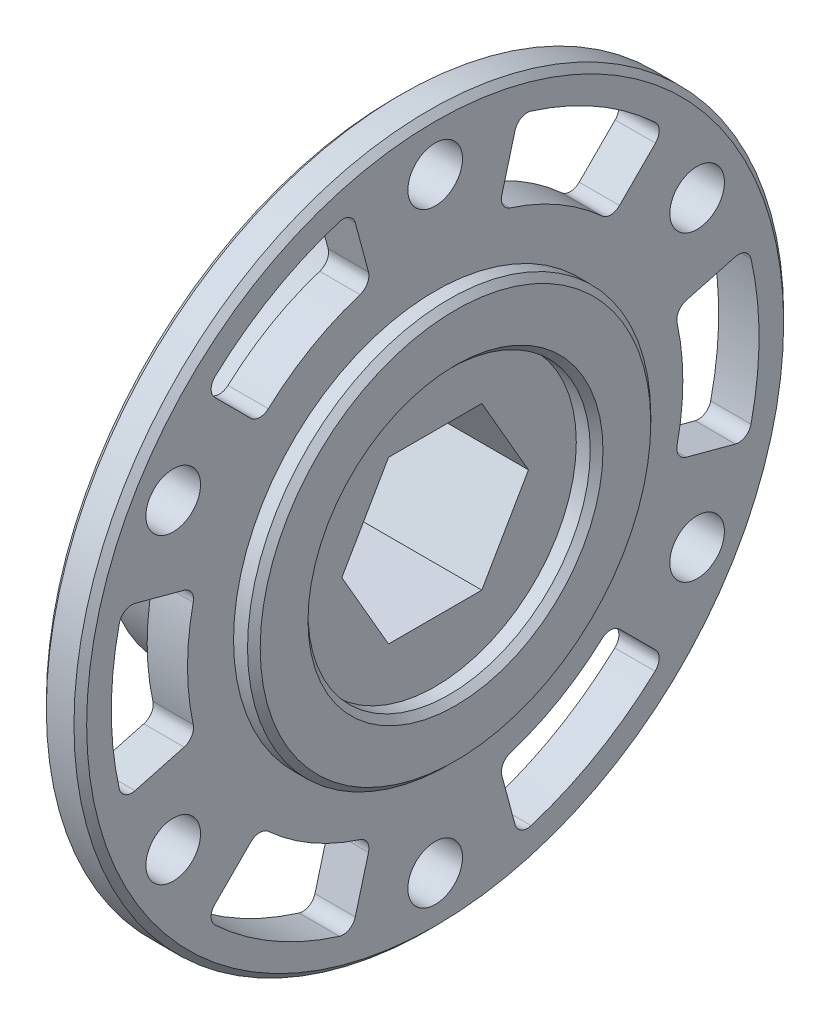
from build123d import *

# Parameters (mm, degrees)
SKETCH1_W                      = 3.175
SKETCH1_H                      = 27.94
SKETCH2_R                      = 15.875
BOSS_EXTRUDE1_DEPTH            = 1.6002
SKETCH3_R                      = 14.295
BOSS_EXTRUDE2_DEPTH            = 9.525
CUT_EXTRUDE1_DEPTH             = 43.021219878
CUT_EXTRUDE2_DEPTH             = 42.503941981
CUT_EXTRUDE3_DEPTH             = 42.503941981
CUT_EXTRUDE4_DEPTH             = 42.503941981
CUT_EXTRUDE5_DEPTH             = 42.503941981
CUT_EXTRUDE6_DEPTH             = 42.503941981
CUT_EXTRUDE7_DEPTH             = 41.644960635
SKETCH11_W                     = 1.6002
SKETCH11_H                     = 11.1125
F_4_3_4_3_DIAMETER_HOLE1_D     = 4.3
F_4_3_4_3_DIAMETER_HOLE1_DEPTH = 4.7752
CHAMFER1_SIZE                  = 0.5
CHAMFER2_SIZE                  = 1
FILLET1_R                      = 1


with BuildPart() as part:
    # Sketch1 → Revolve1 (revolve)
    with BuildSketch(Plane(origin=(0, 0, 0), x_dir=(-1, 0, 0), z_dir=(0, 0, -1)), mode=Mode.PRIVATE) as revolve1_sk:
        with Locations((-11.1125, 13.97)):
            Rectangle(SKETCH1_W, SKETCH1_H)
    revolve(revolve1_sk.sketch.rotate(Axis((12.7, 0, 0), (-1, 0, 0)), 270), axis=Axis((12.7, 0, 0), (-1, 0, 0)))

    # Sketch2 → Boss-Extrude1 (add)
    with BuildSketch(Plane(origin=(12.7, 0, 0), x_dir=(0, 0, -1), z_dir=(1, 0, 0))):
        with Locations(Location((0, 0, 0), (0, 0, 180))):
            Circle(SKETCH2_R)
    extrude(amount=BOSS_EXTRUDE1_DEPTH)

    # Sketch3 → Boss-Extrude2 (add)
    with BuildSketch(Plane.ZY.offset(-9.525)):
        with Locations(Location((0, 0, 0), (0, 0, 180))):
            Circle(SKETCH3_R)
    extrude(amount=BOSS_EXTRUDE2_DEPTH)

    # Sketch4 → Cut-Extrude1 (cut, through all)
    with BuildSketch(Plane.ZY):
        Polygon((3.673506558, 6.3627), (-3.673506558, 6.3627), (-7.347013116, 0), (-3.673506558, -6.3627), (3.673506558, -6.3627), (7.347013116, 0), align=None)
    extrude(amount=-CUT_EXTRUDE1_DEPTH, mode=Mode.SUBTRACT)

    # Sketch5 → Cut-Extrude2 (cut, through all)
    with BuildSketch(Plane(origin=(12.7, 0, 0), x_dir=(0, 0, -1), z_dir=(1, 0, 0))):
        with BuildLine():
            Line((-24.618120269, -6.648169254), (-18.822550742, -5.09525108))
            ThreePointArc((-18.822550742, -5.09525108), (-19.5, 0), (-18.822550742, 5.09525108))
            Line((-18.822550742, 5.09525108), (-24.618120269, 6.648169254))
            ThreePointArc((-24.618120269, 6.648169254), (-25.5, 0), (-24.618120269, -6.648169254))
        make_face()
    extrude(amount=-CUT_EXTRUDE2_DEPTH, mode=Mode.SUBTRACT)

    # Sketch6 → Cut-Extrude3 (cut, through all)
    with BuildSketch(Plane(origin=(12.7, 0, 0), x_dir=(0, 0, -1), z_dir=(1, 0, 0))):
        with BuildLine():
            Line((-18.066543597, 17.995832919), (-13.823892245, 13.753181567))
            ThreePointArc((-13.823892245, 13.753181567), (-9.75, 16.887495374), (-4.998658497, 18.848432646))
            Line((-4.998658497, 18.848432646), (-6.551576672, 24.644002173))
            ThreePointArc((-6.551576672, 24.644002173), (-12.75, 22.083647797), (-18.066543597, 17.995832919))
        make_face()
    extrude(amount=-CUT_EXTRUDE3_DEPTH, mode=Mode.SUBTRACT)

    # Sketch7 → Cut-Extrude4 (cut, through all)
    with BuildSketch(Plane(origin=(12.7, 0, 0), x_dir=(0, 0, -1), z_dir=(1, 0, 0))):
        with BuildLine():
            Line((6.551576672, 24.644002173), (4.998658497, 18.848432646))
            ThreePointArc((4.998658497, 18.848432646), (9.75, 16.887495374), (13.823892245, 13.753181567))
            Line((13.823892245, 13.753181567), (18.066543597, 17.995832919))
            ThreePointArc((18.066543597, 17.995832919), (12.75, 22.083647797), (6.551576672, 24.644002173))
        make_face()
    extrude(amount=-CUT_EXTRUDE4_DEPTH, mode=Mode.SUBTRACT)

    # Sketch8 → Cut-Extrude5 (cut, through all)
    with BuildSketch(Plane(origin=(12.7, 0, 0), x_dir=(0, 0, -1), z_dir=(1, 0, 0))):
        with BuildLine():
            Line((24.618120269, 6.648169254), (18.822550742, 5.09525108))
            ThreePointArc((18.822550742, 5.09525108), (19.5, 0), (18.822550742, -5.09525108))
            Line((18.822550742, -5.09525108), (24.618120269, -6.648169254))
            ThreePointArc((24.618120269, -6.648169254), (25.5, 0), (24.618120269, 6.648169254))
        make_face()
    extrude(amount=-CUT_EXTRUDE5_DEPTH, mode=Mode.SUBTRACT)

    # Sketch9 → Cut-Extrude6 (cut, through all)
    with BuildSketch(Plane(origin=(12.7, 0, 0), x_dir=(0, 0, -1), z_dir=(1, 0, 0))):
        with BuildLine():
            Line((18.066543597, -17.995832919), (13.823892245, -13.753181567))
            ThreePointArc((13.823892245, -13.753181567), (9.75, -16.887495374), (4.998658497, -18.848432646))
            Line((4.998658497, -18.848432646), (6.551576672, -24.644002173))
            ThreePointArc((6.551576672, -24.644002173), (12.75, -22.083647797), (18.066543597, -17.995832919))
        make_face()
    extrude(amount=-CUT_EXTRUDE6_DEPTH, mode=Mode.SUBTRACT)

    # Sketch10 → Cut-Extrude7 (cut, through all)
    with BuildSketch(Plane.ZY.offset(-9.525)):
        with BuildLine():
            Line((18.066543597, -17.995832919), (13.823892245, -13.753181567))
            ThreePointArc((13.823892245, -13.753181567), (9.75, -16.887495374), (4.998658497, -18.848432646))
            Line((4.998658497, -18.848432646), (6.551576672, -24.644002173))
            ThreePointArc((6.551576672, -24.644002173), (12.75, -22.083647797), (18.066543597, -17.995832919))
        make_face()
    extrude(amount=-CUT_EXTRUDE7_DEPTH, mode=Mode.SUBTRACT)

    # Sketch11 → Cut-Revolve1 (revolve, cut)
    with BuildSketch(Plane(origin=(0, 0, 0), x_dir=(1, 0, 0), z_dir=(0, 1, 0))):
        with Locations((13.5001, 5.55625)):
            Rectangle(SKETCH11_W, SKETCH11_H)
    revolve(axis=Axis((12.7, 0, 0), (1, 0, 0)), mode=Mode.SUBTRACT)

    # 4.3 _4.3_ Diameter Hole1
    with Locations(Plane.ZY.offset(-9.525)):
        with Locations((-20.624394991, -11.9075), (-20.624394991, 11.9075), (0, 23.815), (20.624394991, 11.9075), (20.624394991, -11.9075), (0, -23.815)):
            Hole(F_4_3_4_3_DIAMETER_HOLE1_D / 2, depth=F_4_3_4_3_DIAMETER_HOLE1_DEPTH)

    # Chamfer1
    chamfer1_edges = [part.edges().sort_by_distance(p)[0] for p in [
        (14.3002, 0, 11.1125),
        (9.525, 0, -27.94),
        (12.7, 0, -27.94),
        (14.3002, 0, -15.875),
    ]]
    chamfer(chamfer1_edges, length=CHAMFER1_SIZE)

    # Chamfer2
    chamfer2_edges = [part.edges().sort_by_distance(p)[0] for p in [
        (0, 0, 14.295),
    ]]
    chamfer(chamfer2_edges, length=CHAMFER2_SIZE)

    # Fillet1
    fillet1_edges = [part.edges().sort_by_distance(p)[0] for p in [
        (11.1125, 6.648169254, -24.618120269),
        (11.1125, -6.648169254, -24.618120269),
        (11.1125, -5.09525108, -18.822550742),
        (11.1125, 5.09525108, -18.822550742),
        (11.1125, -17.995832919, -18.066543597),
        (11.1125, -24.644002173, -6.551576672),
        (11.1125, -18.848432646, -4.998658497),
        (11.1125, -13.753181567, -13.823892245),
        (9.525, 0, 14.295),
        (11.1125, -17.995832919, 18.066543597),
        (11.1125, -24.644002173, 6.551576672),
        (11.1125, -18.848432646, 4.998658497),
        (11.1125, -13.753181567, 13.823892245),
        (11.1125, -6.648169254, 24.618120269),
        (11.1125, 6.648169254, 24.618120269),
        (11.1125, 5.09525108, 18.822550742),
        (11.1125, -5.09525108, 18.822550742),
        (11.1125, 17.995832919, 18.066543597),
        (11.1125, 24.644002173, 6.551576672),
        (11.1125, 18.848432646, 4.998658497),
        (11.1125, 13.753181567, 13.823892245),
        (11.1125, 24.644002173, -6.551576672),
        (11.1125, 17.995832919, -18.066543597),
        (11.1125, 13.753181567, -13.823892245),
        (11.1125, 18.848432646, -4.998658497),
    ]]
    fillet(fillet1_edges, radius=FILLET1_R)


solid = part.part
